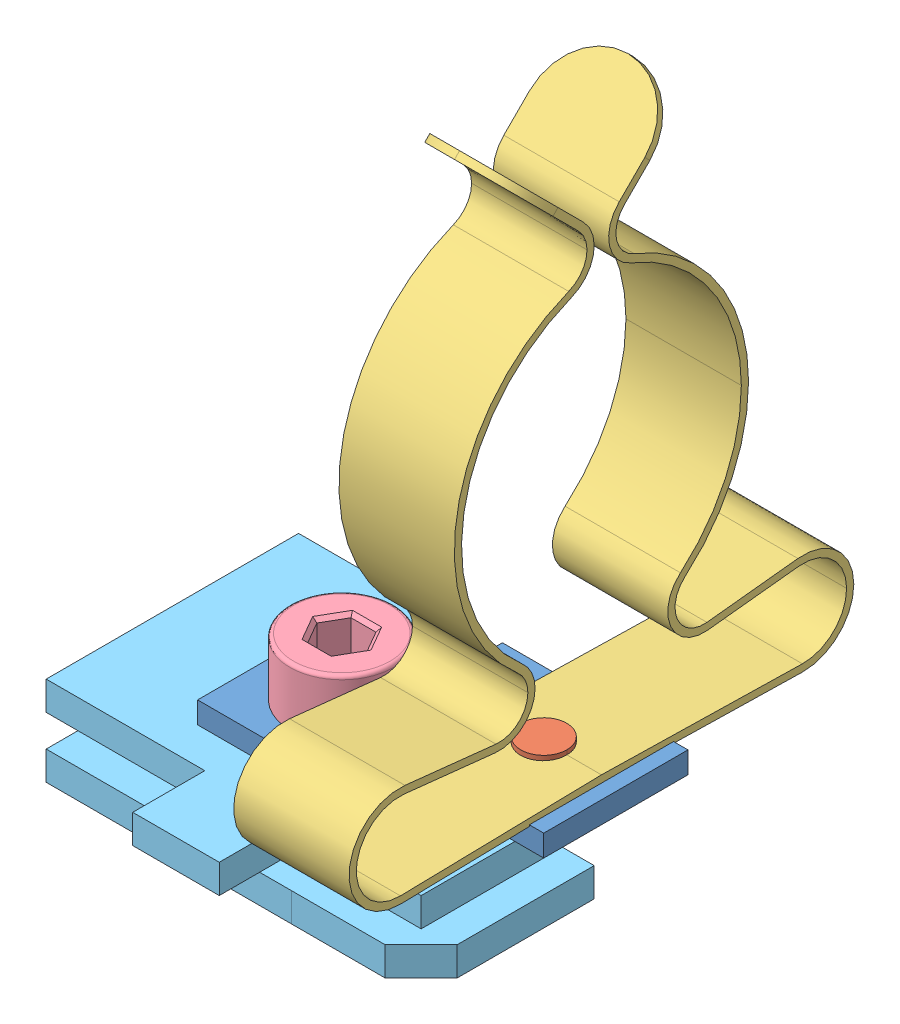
SolidWorks assembly 36259_100.SLDASM, configuration Default (file format 8000). Lengths in mm.
Overall size (32 52.9 35).
5 component instances, 5 part files, 0 mates.
Components (placement in the parent):
- 36259_100_01-1: 36259_100_01.SLDPRT [Default] at origin size (24 5.5 10)
- 36259_100_02-1: 36259_100_02.SLDPRT [Default] at origin size (6 3.3 6)
- 36259_100_03-1: 36259_100_03.SLDPRT [Default] at origin size (8 39.2 35)
- 36259_100_04-1: 36259_100_04.SLDPRT [Default] at origin size (7.2 14 7.2)
- 36259_100_05-1: 36259_100_05.SLDPRT [Default] at origin size (26 6.2 22.5)
